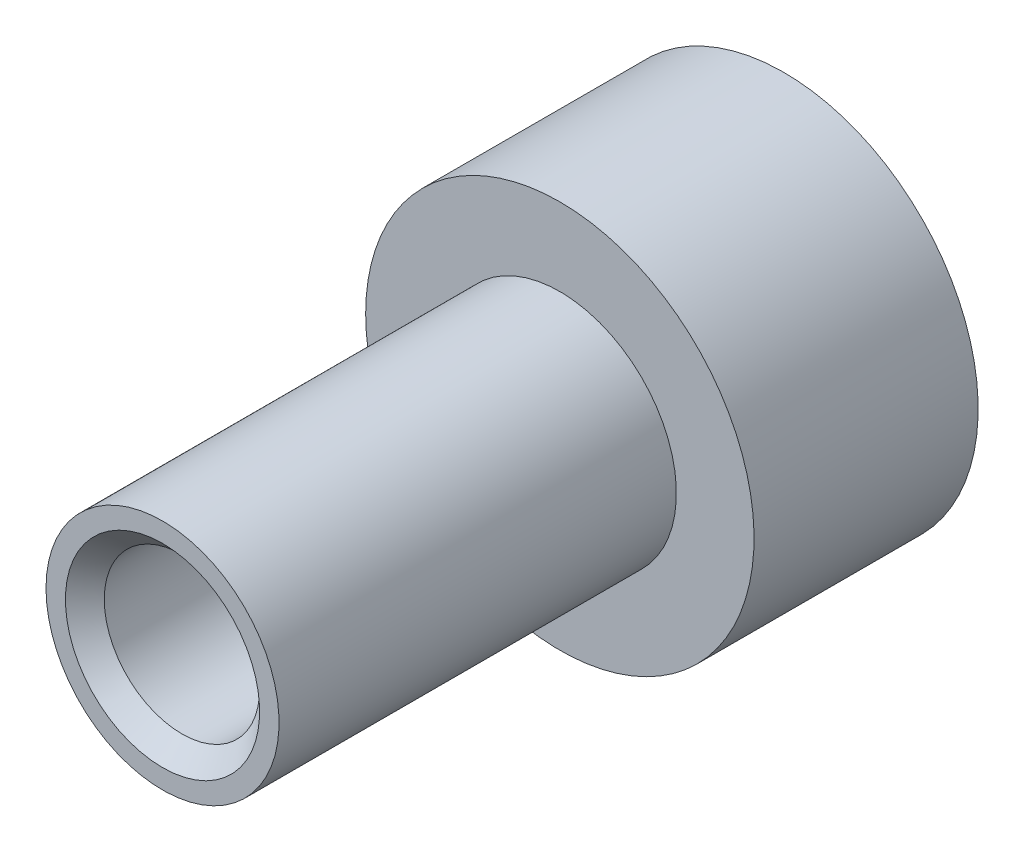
from build123d import *

# Parameters (mm, degrees)
SKETCH2_R           = 3
SKETCH2_R_2         = 2
BOSS_EXTRUDE1_DEPTH = 16
SKETCH3_R           = 5
SKETCH3_R_2         = 3
BOSS_EXTRUDE2_DEPTH = 5.77
CHAMFER1_SIZE       = 0.5


with BuildPart() as part:
    # Sketch2 → Boss-Extrude1 (new body)
    with BuildSketch(Plane.XY.offset(-7.872226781)):
        with Locations(Location((-40.729143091, -59.295, 0), (0, 0, 180))):
            Circle(SKETCH2_R)
        with Locations(Location((-40.729143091, -59.295, 0), (0, 0, 180))):
            Circle(SKETCH2_R_2, mode=Mode.SUBTRACT)
    extrude(amount=BOSS_EXTRUDE1_DEPTH)

    # Sketch3 → Boss-Extrude2 (add)
    with BuildSketch(Plane(origin=(0, 0, -7.872226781), x_dir=(-1, 0, 0), z_dir=(0, 0, -1))):
        with Locations((40.729143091, -59.295)):
            Circle(SKETCH3_R)
        with Locations((40.729143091, -59.295)):
            Circle(SKETCH3_R_2, mode=Mode.SUBTRACT)
    extrude(amount=-BOSS_EXTRUDE2_DEPTH)

    # Chamfer1
    chamfer1_edges = [part.edges().sort_by_distance(p)[0] for p in [
        (-38.729143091, -59.295, -7.872226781),
        (-38.729143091, -59.295, 8.127773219),
    ]]
    chamfer(chamfer1_edges, length=CHAMFER1_SIZE)


solid = part.part
